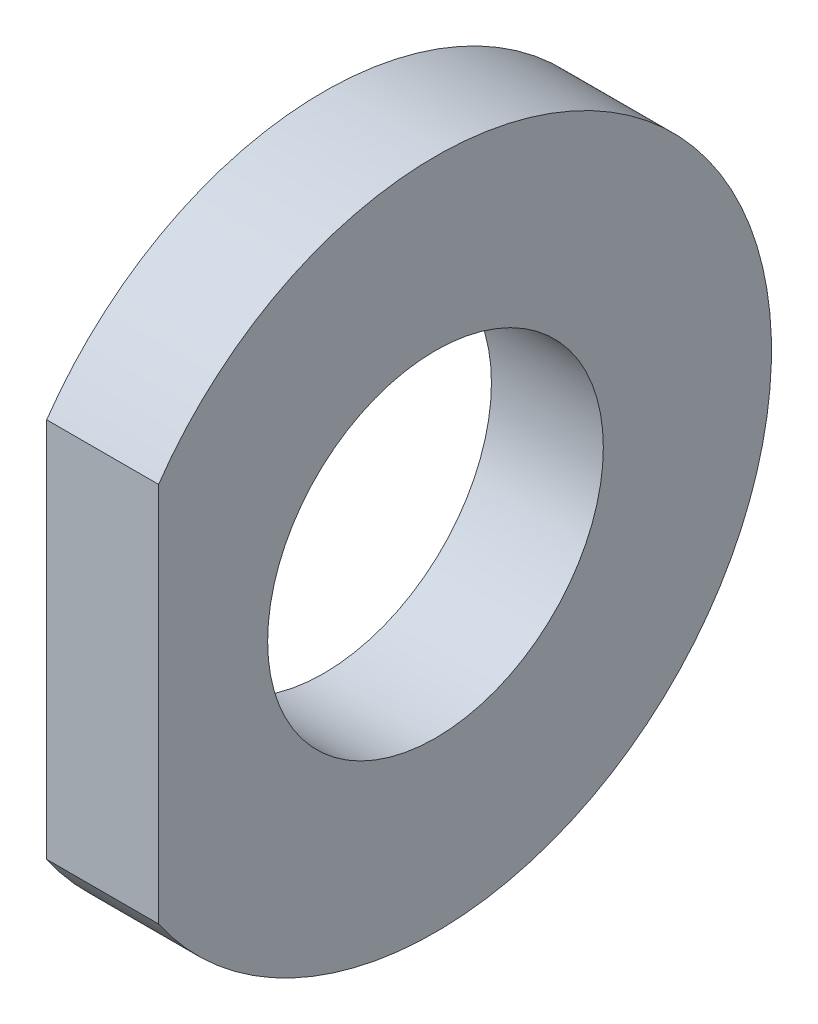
ISO-10303-21;
HEADER;
FILE_DESCRIPTION(('STEP AP214'),'2;1');
FILE_NAME('part.step','',(''),(''),'','','');
FILE_SCHEMA(('AUTOMOTIVE_DESIGN { 1 0 10303 214 1 1 1 1 }'));
ENDSEC;
DATA;
#1=APPLICATION_CONTEXT('core data for automotive mechanical design processes');
#2=APPLICATION_PROTOCOL_DEFINITION('international standard','automotive_design',2000,#1);
#3=PRODUCT_CONTEXT('',#1,'mechanical');
#4=PRODUCT('Part','Part','',(#3));
#5=PRODUCT_RELATED_PRODUCT_CATEGORY('part','',(#4));
#6=PRODUCT_DEFINITION_FORMATION('','',#4);
#7=PRODUCT_DEFINITION_CONTEXT('part definition',#1,'design');
#8=PRODUCT_DEFINITION('design','',#6,#7);
#9=PRODUCT_DEFINITION_SHAPE('','',#8);
#10=(LENGTH_UNIT() NAMED_UNIT(*) SI_UNIT(.MILLI.,.METRE.));
#11=(NAMED_UNIT(*) PLANE_ANGLE_UNIT() SI_UNIT($,.RADIAN.));
#12=(NAMED_UNIT(*) SI_UNIT($,.STERADIAN.) SOLID_ANGLE_UNIT());
#13=UNCERTAINTY_MEASURE_WITH_UNIT(LENGTH_MEASURE(1.E-05),#10,'distance_accuracy_value','');
#14=(GEOMETRIC_REPRESENTATION_CONTEXT(3) GLOBAL_UNCERTAINTY_ASSIGNED_CONTEXT((#13)) GLOBAL_UNIT_ASSIGNED_CONTEXT((#10,
#11,#12)) REPRESENTATION_CONTEXT('',''));
#15=CARTESIAN_POINT('',(0.,0.,0.));
#16=DIRECTION('',(0.,0.,1.));
#17=DIRECTION('',(1.,0.,0.));
#18=AXIS2_PLACEMENT_3D('',#15,#16,#17);
#19=CARTESIAN_POINT('',(0.,6.7437,0.));
#20=DIRECTION('',(1.,0.,0.));
#21=DIRECTION('',(0.,0.,-1.));
#22=AXIS2_PLACEMENT_3D('',#19,#20,#21);
#23=PLANE('',#22);
#24=CARTESIAN_POINT('',(0.,0.,0.));
#25=DIRECTION('',(1.,0.,0.));
#26=DIRECTION('',(0.,0.,-1.));
#27=AXIS2_PLACEMENT_3D('',#24,#25,#26);
#28=CIRCLE('',#27,6.7437);
#29=CARTESIAN_POINT('',(0.,0.,-6.7437));
#30=VERTEX_POINT('',#29);
#31=EDGE_CURVE('E77',#30,#30,#28,.T.);
#32=ORIENTED_EDGE('',*,*,#31,.F.);
#33=EDGE_LOOP('',(#32));
#34=FACE_BOUND('',#33,.T.);
#35=CARTESIAN_POINT('',(0.,0.,0.));
#36=DIRECTION('',(1.,0.,0.));
#37=DIRECTION('',(0.,0.,-1.));
#38=AXIS2_PLACEMENT_3D('',#35,#36,#37);
#39=CIRCLE('',#38,13.5001);
#40=CARTESIAN_POINT('',(0.,-7.64739334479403,11.1252));
#41=VERTEX_POINT('',#40);
#42=CARTESIAN_POINT('',(0.,7.64739334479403,11.1252));
#43=VERTEX_POINT('',#42);
#44=EDGE_CURVE('E50',#41,#43,#39,.T.);
#45=ORIENTED_EDGE('',*,*,#44,.T.);
#46=DIRECTION('',(0.,-1.,0.));
#47=VECTOR('',#46,1.);
#48=CARTESIAN_POINT('',(0.,6.7437,11.1252));
#49=LINE('',#48,#47);
#50=EDGE_CURVE('E75',#43,#41,#49,.T.);
#51=ORIENTED_EDGE('',*,*,#50,.T.);
#52=EDGE_LOOP('',(#45,#51));
#53=FACE_BOUND('',#52,.T.);
#54=ADVANCED_FACE('F37',(#34,#53),#23,.T.);
#55=CARTESIAN_POINT('',(0.,0.,0.));
#56=DIRECTION('',(1.,0.,0.));
#57=DIRECTION('',(0.,0.,-1.));
#58=AXIS2_PLACEMENT_3D('',#55,#56,#57);
#59=CYLINDRICAL_SURFACE('',#58,13.5001);
#60=ORIENTED_EDGE('',*,*,#44,.F.);
#61=DIRECTION('',(1.,0.,0.));
#62=VECTOR('',#61,1.);
#63=CARTESIAN_POINT('',(0.,-7.64739334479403,11.1252));
#64=LINE('',#63,#62);
#65=CARTESIAN_POINT('',(-4.4958,-7.64739334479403,11.1252));
#66=VERTEX_POINT('',#65);
#67=EDGE_CURVE('E59',#41,#66,#64,.F.);
#68=ORIENTED_EDGE('',*,*,#67,.T.);
#69=CARTESIAN_POINT('',(-4.4958,0.,0.));
#70=DIRECTION('',(1.,0.,0.));
#71=DIRECTION('',(0.,0.,-1.));
#72=AXIS2_PLACEMENT_3D('',#69,#70,#71);
#73=CIRCLE('',#72,13.5001);
#74=CARTESIAN_POINT('',(-4.4958,7.64739334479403,11.1252));
#75=VERTEX_POINT('',#74);
#76=EDGE_CURVE('E66',#66,#75,#73,.T.);
#77=ORIENTED_EDGE('',*,*,#76,.T.);
#78=DIRECTION('',(1.,0.,0.));
#79=VECTOR('',#78,1.);
#80=CARTESIAN_POINT('',(0.,7.64739334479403,11.1252));
#81=LINE('',#80,#79);
#82=EDGE_CURVE('E53',#75,#43,#81,.T.);
#83=ORIENTED_EDGE('',*,*,#82,.T.);
#84=EDGE_LOOP('',(#60,#68,#77,#83));
#85=FACE_BOUND('',#84,.T.);
#86=ADVANCED_FACE('F70',(#85),#59,.T.);
#87=CARTESIAN_POINT('',(-4.4958,6.7437,0.));
#88=DIRECTION('',(-1.,0.,0.));
#89=DIRECTION('',(0.,0.,1.));
#90=AXIS2_PLACEMENT_3D('',#87,#88,#89);
#91=PLANE('',#90);
#92=CARTESIAN_POINT('',(-4.4958,0.,0.));
#93=DIRECTION('',(1.,0.,0.));
#94=DIRECTION('',(0.,0.,-1.));
#95=AXIS2_PLACEMENT_3D('',#92,#93,#94);
#96=CIRCLE('',#95,6.7437);
#97=CARTESIAN_POINT('',(-4.4958,0.,-6.7437));
#98=VERTEX_POINT('',#97);
#99=EDGE_CURVE('E73',#98,#98,#96,.T.);
#100=ORIENTED_EDGE('',*,*,#99,.T.);
#101=EDGE_LOOP('',(#100));
#102=FACE_BOUND('',#101,.T.);
#103=ORIENTED_EDGE('',*,*,#76,.F.);
#104=DIRECTION('',(0.,1.,0.));
#105=VECTOR('',#104,1.);
#106=CARTESIAN_POINT('',(-4.4958,6.7437,11.1252));
#107=LINE('',#106,#105);
#108=EDGE_CURVE('E12',#66,#75,#107,.T.);
#109=ORIENTED_EDGE('',*,*,#108,.T.);
#110=EDGE_LOOP('',(#103,#109));
#111=FACE_BOUND('',#110,.T.);
#112=ADVANCED_FACE('F74',(#102,#111),#91,.T.);
#113=CARTESIAN_POINT('',(0.,0.,0.));
#114=DIRECTION('',(1.,0.,0.));
#115=DIRECTION('',(0.,0.,-1.));
#116=AXIS2_PLACEMENT_3D('',#113,#114,#115);
#117=CYLINDRICAL_SURFACE('',#116,6.7437);
#118=ORIENTED_EDGE('',*,*,#31,.T.);
#119=EDGE_LOOP('',(#118));
#120=FACE_BOUND('',#119,.T.);
#121=ORIENTED_EDGE('',*,*,#99,.F.);
#122=EDGE_LOOP('',(#121));
#123=FACE_BOUND('',#122,.T.);
#124=ADVANCED_FACE('F91',(#120,#123),#117,.F.);
#125=CARTESIAN_POINT('',(0.,0.,11.1252));
#126=DIRECTION('',(0.,0.,1.));
#127=DIRECTION('',(1.,0.,0.));
#128=AXIS2_PLACEMENT_3D('',#125,#126,#127);
#129=PLANE('',#128);
#130=ORIENTED_EDGE('',*,*,#50,.F.);
#131=ORIENTED_EDGE('',*,*,#82,.F.);
#132=ORIENTED_EDGE('',*,*,#108,.F.);
#133=ORIENTED_EDGE('',*,*,#67,.F.);
#134=EDGE_LOOP('',(#130,#131,#132,#133));
#135=FACE_BOUND('',#134,.T.);
#136=ADVANCED_FACE('F62',(#135),#129,.T.);
#137=CLOSED_SHELL('',(#54,#86,#112,#124,#136));
#138=MANIFOLD_SOLID_BREP('B2',#137);
#139=ADVANCED_BREP_SHAPE_REPRESENTATION('',(#18,#138),#14);
#140=SHAPE_DEFINITION_REPRESENTATION(#9,#139);
ENDSEC;
END-ISO-10303-21;
